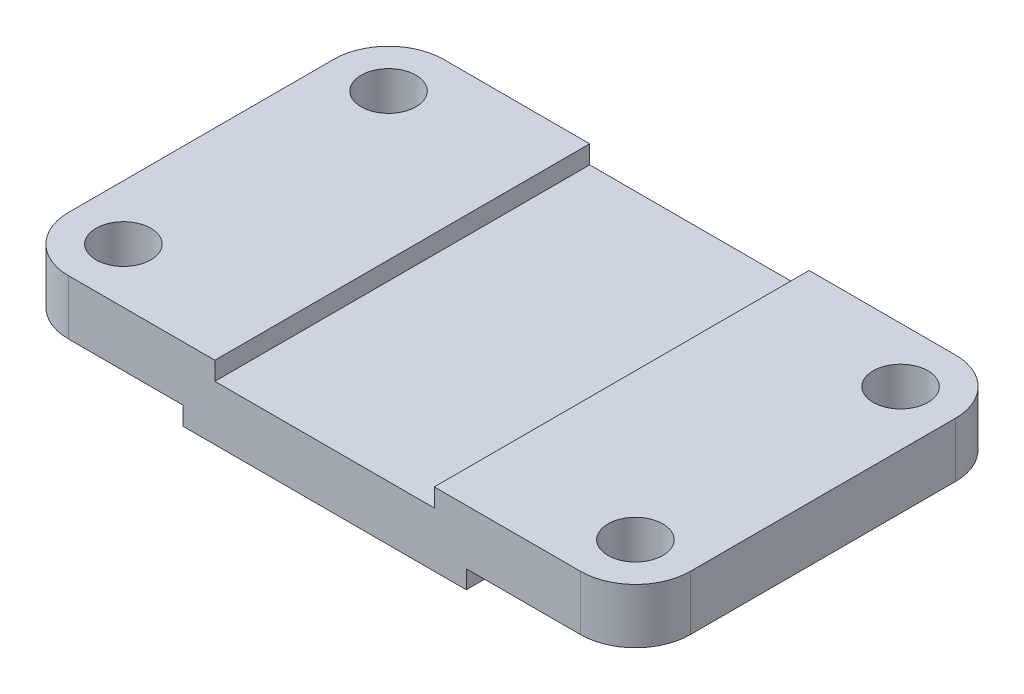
ISO-10303-21;
HEADER;
FILE_DESCRIPTION(('STEP AP214'),'2;1');
FILE_NAME('part.step','',(''),(''),'','','');
FILE_SCHEMA(('AUTOMOTIVE_DESIGN { 1 0 10303 214 1 1 1 1 }'));
ENDSEC;
DATA;
#1=APPLICATION_CONTEXT('core data for automotive mechanical design processes');
#2=APPLICATION_PROTOCOL_DEFINITION('international standard','automotive_design',2000,#1);
#3=PRODUCT_CONTEXT('',#1,'mechanical');
#4=PRODUCT('Part','Part','',(#3));
#5=PRODUCT_RELATED_PRODUCT_CATEGORY('part','',(#4));
#6=PRODUCT_DEFINITION_FORMATION('','',#4);
#7=PRODUCT_DEFINITION_CONTEXT('part definition',#1,'design');
#8=PRODUCT_DEFINITION('design','',#6,#7);
#9=PRODUCT_DEFINITION_SHAPE('','',#8);
#10=(LENGTH_UNIT() NAMED_UNIT(*) SI_UNIT(.MILLI.,.METRE.));
#11=(NAMED_UNIT(*) PLANE_ANGLE_UNIT() SI_UNIT($,.RADIAN.));
#12=(NAMED_UNIT(*) SI_UNIT($,.STERADIAN.) SOLID_ANGLE_UNIT());
#13=UNCERTAINTY_MEASURE_WITH_UNIT(LENGTH_MEASURE(1.E-05),#10,'distance_accuracy_value','');
#14=(GEOMETRIC_REPRESENTATION_CONTEXT(3) GLOBAL_UNCERTAINTY_ASSIGNED_CONTEXT((#13)) GLOBAL_UNIT_ASSIGNED_CONTEXT((#10,
#11,#12)) REPRESENTATION_CONTEXT('',''));
#15=CARTESIAN_POINT('',(0.,0.,0.));
#16=DIRECTION('',(0.,0.,1.));
#17=DIRECTION('',(1.,0.,0.));
#18=AXIS2_PLACEMENT_3D('',#15,#16,#17);
#19=CARTESIAN_POINT('',(-31.,4.00000000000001,41.));
#20=DIRECTION('',(1.,0.,0.));
#21=DIRECTION('',(0.,0.,-1.));
#22=AXIS2_PLACEMENT_3D('',#19,#20,#21);
#23=PLANE('',#22);
#24=DIRECTION('',(0.,-1.,0.));
#25=VECTOR('',#24,1.);
#26=CARTESIAN_POINT('',(-31.,4.00000000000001,-41.));
#27=LINE('',#26,#25);
#28=CARTESIAN_POINT('',(-31.,4.00000000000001,-41.));
#29=VERTEX_POINT('',#28);
#30=CARTESIAN_POINT('',(-31.,0.,-41.));
#31=VERTEX_POINT('',#30);
#32=EDGE_CURVE('E174',#29,#31,#27,.T.);
#33=ORIENTED_EDGE('',*,*,#32,.T.);
#34=DIRECTION('',(0.,0.,-1.));
#35=VECTOR('',#34,1.);
#36=CARTESIAN_POINT('',(-31.,0.,41.));
#37=LINE('',#36,#35);
#38=CARTESIAN_POINT('',(-31.,0.,41.));
#39=VERTEX_POINT('',#38);
#40=EDGE_CURVE('E154',#39,#31,#37,.T.);
#41=ORIENTED_EDGE('',*,*,#40,.F.);
#42=DIRECTION('',(0.,-1.,0.));
#43=VECTOR('',#42,1.);
#44=CARTESIAN_POINT('',(-31.,4.00000000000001,41.));
#45=LINE('',#44,#43);
#46=CARTESIAN_POINT('',(-31.,4.00000000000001,41.));
#47=VERTEX_POINT('',#46);
#48=EDGE_CURVE('E161',#47,#39,#45,.T.);
#49=ORIENTED_EDGE('',*,*,#48,.F.);
#50=DIRECTION('',(0.,0.,-1.));
#51=VECTOR('',#50,1.);
#52=CARTESIAN_POINT('',(-31.,4.00000000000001,41.));
#53=LINE('',#52,#51);
#54=EDGE_CURVE('E247',#47,#29,#53,.T.);
#55=ORIENTED_EDGE('',*,*,#54,.T.);
#56=EDGE_LOOP('',(#33,#41,#49,#55));
#57=FACE_BOUND('',#56,.T.);
#58=ADVANCED_FACE('F33',(#57),#23,.F.);
#59=CARTESIAN_POINT('',(-31.,0.,41.));
#60=DIRECTION('',(0.,1.,0.));
#61=DIRECTION('',(-1.,0.,0.));
#62=AXIS2_PLACEMENT_3D('',#59,#60,#61);
#63=PLANE('',#62);
#64=DIRECTION('',(1.,0.,0.));
#65=VECTOR('',#64,1.);
#66=CARTESIAN_POINT('',(-31.,0.,-41.));
#67=LINE('',#66,#65);
#68=CARTESIAN_POINT('',(31.,0.,-41.));
#69=VERTEX_POINT('',#68);
#70=EDGE_CURVE('E249',#31,#69,#67,.T.);
#71=ORIENTED_EDGE('',*,*,#70,.T.);
#72=DIRECTION('',(0.,0.,-1.));
#73=VECTOR('',#72,1.);
#74=CARTESIAN_POINT('',(31.,0.,41.));
#75=LINE('',#74,#73);
#76=CARTESIAN_POINT('',(31.,0.,41.));
#77=VERTEX_POINT('',#76);
#78=EDGE_CURVE('E157',#77,#69,#75,.T.);
#79=ORIENTED_EDGE('',*,*,#78,.F.);
#80=DIRECTION('',(1.,0.,0.));
#81=VECTOR('',#80,1.);
#82=CARTESIAN_POINT('',(-31.,0.,41.));
#83=LINE('',#82,#81);
#84=EDGE_CURVE('E150',#39,#77,#83,.T.);
#85=ORIENTED_EDGE('',*,*,#84,.F.);
#86=ORIENTED_EDGE('',*,*,#40,.T.);
#87=EDGE_LOOP('',(#71,#79,#85,#86));
#88=FACE_BOUND('',#87,.T.);
#89=ADVANCED_FACE('F152',(#88),#63,.F.);
#90=CARTESIAN_POINT('',(31.,0.,41.));
#91=DIRECTION('',(-1.,0.,0.));
#92=DIRECTION('',(0.,0.,1.));
#93=AXIS2_PLACEMENT_3D('',#90,#91,#92);
#94=PLANE('',#93);
#95=DIRECTION('',(0.,1.,0.));
#96=VECTOR('',#95,1.);
#97=CARTESIAN_POINT('',(31.,0.,-41.));
#98=LINE('',#97,#96);
#99=CARTESIAN_POINT('',(31.,4.00000000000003,-41.));
#100=VERTEX_POINT('',#99);
#101=EDGE_CURVE('E251',#69,#100,#98,.T.);
#102=ORIENTED_EDGE('',*,*,#101,.T.);
#103=DIRECTION('',(0.,0.,-1.));
#104=VECTOR('',#103,1.);
#105=CARTESIAN_POINT('',(31.,4.00000000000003,41.));
#106=LINE('',#105,#104);
#107=CARTESIAN_POINT('',(31.,4.00000000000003,41.));
#108=VERTEX_POINT('',#107);
#109=EDGE_CURVE('E179',#108,#100,#106,.T.);
#110=ORIENTED_EDGE('',*,*,#109,.F.);
#111=DIRECTION('',(0.,1.,0.));
#112=VECTOR('',#111,1.);
#113=CARTESIAN_POINT('',(31.,0.,41.));
#114=LINE('',#113,#112);
#115=EDGE_CURVE('E160',#77,#108,#114,.T.);
#116=ORIENTED_EDGE('',*,*,#115,.F.);
#117=ORIENTED_EDGE('',*,*,#78,.T.);
#118=EDGE_LOOP('',(#102,#110,#116,#117));
#119=FACE_BOUND('',#118,.T.);
#120=ADVANCED_FACE('F349',(#119),#94,.F.);
#121=CARTESIAN_POINT('',(31.,4.00000000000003,41.));
#122=DIRECTION('',(0.,1.,0.));
#123=DIRECTION('',(-1.,0.,0.));
#124=AXIS2_PLACEMENT_3D('',#121,#122,#123);
#125=PLANE('',#124);
#126=CARTESIAN_POINT('',(56.,4.00000000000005,29.));
#127=DIRECTION('',(0.,1.,0.));
#128=DIRECTION('',(-1.,0.,0.));
#129=AXIS2_PLACEMENT_3D('',#126,#127,#128);
#130=CIRCLE('',#129,6.);
#131=CARTESIAN_POINT('',(50.,4.00000000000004,29.));
#132=VERTEX_POINT('',#131);
#133=EDGE_CURVE('E229',#132,#132,#130,.T.);
#134=ORIENTED_EDGE('',*,*,#133,.T.);
#135=EDGE_LOOP('',(#134));
#136=FACE_BOUND('',#135,.T.);
#137=CARTESIAN_POINT('',(56.,4.00000000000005,-29.));
#138=DIRECTION('',(0.,1.,0.));
#139=DIRECTION('',(-1.,0.,0.));
#140=AXIS2_PLACEMENT_3D('',#137,#138,#139);
#141=CIRCLE('',#140,6.);
#142=CARTESIAN_POINT('',(50.,4.00000000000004,-29.));
#143=VERTEX_POINT('',#142);
#144=EDGE_CURVE('E214',#143,#143,#141,.T.);
#145=ORIENTED_EDGE('',*,*,#144,.T.);
#146=EDGE_LOOP('',(#145));
#147=FACE_BOUND('',#146,.T.);
#148=DIRECTION('',(1.,0.,0.));
#149=VECTOR('',#148,1.);
#150=CARTESIAN_POINT('',(31.,4.00000000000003,-41.));
#151=LINE('',#150,#149);
#152=CARTESIAN_POINT('',(56.,4.00000000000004,-41.));
#153=VERTEX_POINT('',#152);
#154=EDGE_CURVE('E253',#100,#153,#151,.T.);
#155=ORIENTED_EDGE('',*,*,#154,.T.);
#156=CARTESIAN_POINT('',(56.,4.00000000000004,-29.));
#157=DIRECTION('',(0.,1.,0.));
#158=DIRECTION('',(-1.,0.,0.));
#159=AXIS2_PLACEMENT_3D('',#156,#157,#158);
#160=CIRCLE('',#159,12.);
#161=CARTESIAN_POINT('',(68.,4.00000000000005,-29.));
#162=VERTEX_POINT('',#161);
#163=EDGE_CURVE('E206',#153,#162,#160,.F.);
#164=ORIENTED_EDGE('',*,*,#163,.T.);
#165=DIRECTION('',(0.,0.,-1.));
#166=VECTOR('',#165,1.);
#167=CARTESIAN_POINT('',(68.,4.00000000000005,41.));
#168=LINE('',#167,#166);
#169=CARTESIAN_POINT('',(68.,4.00000000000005,29.));
#170=VERTEX_POINT('',#169);
#171=EDGE_CURVE('E290',#170,#162,#168,.T.);
#172=ORIENTED_EDGE('',*,*,#171,.F.);
#173=CARTESIAN_POINT('',(56.,4.00000000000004,29.));
#174=DIRECTION('',(0.,1.,0.));
#175=DIRECTION('',(-1.,0.,0.));
#176=AXIS2_PLACEMENT_3D('',#173,#174,#175);
#177=CIRCLE('',#176,12.);
#178=CARTESIAN_POINT('',(56.,4.00000000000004,41.));
#179=VERTEX_POINT('',#178);
#180=EDGE_CURVE('E50',#170,#179,#177,.F.);
#181=ORIENTED_EDGE('',*,*,#180,.T.);
#182=DIRECTION('',(1.,0.,0.));
#183=VECTOR('',#182,1.);
#184=CARTESIAN_POINT('',(31.,4.00000000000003,41.));
#185=LINE('',#184,#183);
#186=EDGE_CURVE('E233',#108,#179,#185,.T.);
#187=ORIENTED_EDGE('',*,*,#186,.F.);
#188=ORIENTED_EDGE('',*,*,#109,.T.);
#189=EDGE_LOOP('',(#155,#164,#172,#181,#187,#188));
#190=FACE_BOUND('',#189,.T.);
#191=ADVANCED_FACE('F295',(#136,#147,#190),#125,.F.);
#192=CARTESIAN_POINT('',(68.,4.00000000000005,41.));
#193=DIRECTION('',(-1.,0.,0.));
#194=DIRECTION('',(0.,0.,1.));
#195=AXIS2_PLACEMENT_3D('',#192,#193,#194);
#196=PLANE('',#195);
#197=ORIENTED_EDGE('',*,*,#171,.T.);
#198=DIRECTION('',(0.,1.,0.));
#199=VECTOR('',#198,1.);
#200=CARTESIAN_POINT('',(68.,4.00000000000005,-29.));
#201=LINE('',#200,#199);
#202=CARTESIAN_POINT('',(68.,16.,-29.));
#203=VERTEX_POINT('',#202);
#204=EDGE_CURVE('E199',#162,#203,#201,.T.);
#205=ORIENTED_EDGE('',*,*,#204,.T.);
#206=DIRECTION('',(0.,0.,-1.));
#207=VECTOR('',#206,1.);
#208=CARTESIAN_POINT('',(68.,16.,41.));
#209=LINE('',#208,#207);
#210=CARTESIAN_POINT('',(68.,16.,29.));
#211=VERTEX_POINT('',#210);
#212=EDGE_CURVE('E287',#211,#203,#209,.T.);
#213=ORIENTED_EDGE('',*,*,#212,.F.);
#214=DIRECTION('',(0.,1.,0.));
#215=VECTOR('',#214,1.);
#216=CARTESIAN_POINT('',(68.,4.00000000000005,29.));
#217=LINE('',#216,#215);
#218=EDGE_CURVE('E197',#211,#170,#217,.F.);
#219=ORIENTED_EDGE('',*,*,#218,.T.);
#220=EDGE_LOOP('',(#197,#205,#213,#219));
#221=FACE_BOUND('',#220,.T.);
#222=ADVANCED_FACE('F309',(#221),#196,.F.);
#223=CARTESIAN_POINT('',(68.,16.,41.));
#224=DIRECTION('',(0.,-1.,0.));
#225=DIRECTION('',(1.,0.,0.));
#226=AXIS2_PLACEMENT_3D('',#223,#224,#225);
#227=PLANE('',#226);
#228=CARTESIAN_POINT('',(56.,16.,29.));
#229=DIRECTION('',(0.,1.,0.));
#230=DIRECTION('',(-1.,0.,0.));
#231=AXIS2_PLACEMENT_3D('',#228,#229,#230);
#232=CIRCLE('',#231,6.);
#233=CARTESIAN_POINT('',(50.,16.,29.));
#234=VERTEX_POINT('',#233);
#235=EDGE_CURVE('E221',#234,#234,#232,.T.);
#236=ORIENTED_EDGE('',*,*,#235,.F.);
#237=EDGE_LOOP('',(#236));
#238=FACE_BOUND('',#237,.T.);
#239=CARTESIAN_POINT('',(56.,16.,-29.));
#240=DIRECTION('',(0.,1.,0.));
#241=DIRECTION('',(-1.,0.,0.));
#242=AXIS2_PLACEMENT_3D('',#239,#240,#241);
#243=CIRCLE('',#242,6.);
#244=CARTESIAN_POINT('',(50.,16.,-29.));
#245=VERTEX_POINT('',#244);
#246=EDGE_CURVE('E216',#245,#245,#243,.T.);
#247=ORIENTED_EDGE('',*,*,#246,.F.);
#248=EDGE_LOOP('',(#247));
#249=FACE_BOUND('',#248,.T.);
#250=ORIENTED_EDGE('',*,*,#212,.T.);
#251=CARTESIAN_POINT('',(56.,16.,-29.));
#252=DIRECTION('',(0.,-1.,0.));
#253=DIRECTION('',(1.,0.,0.));
#254=AXIS2_PLACEMENT_3D('',#251,#252,#253);
#255=CIRCLE('',#254,12.);
#256=CARTESIAN_POINT('',(56.,16.,-41.));
#257=VERTEX_POINT('',#256);
#258=EDGE_CURVE('E203',#203,#257,#255,.F.);
#259=ORIENTED_EDGE('',*,*,#258,.T.);
#260=DIRECTION('',(-1.,0.,0.));
#261=VECTOR('',#260,1.);
#262=CARTESIAN_POINT('',(68.,16.,-41.));
#263=LINE('',#262,#261);
#264=CARTESIAN_POINT('',(24.,16.,-41.));
#265=VERTEX_POINT('',#264);
#266=EDGE_CURVE('E256',#257,#265,#263,.T.);
#267=ORIENTED_EDGE('',*,*,#266,.T.);
#268=DIRECTION('',(0.,0.,-1.));
#269=VECTOR('',#268,1.);
#270=CARTESIAN_POINT('',(24.,16.,41.));
#271=LINE('',#270,#269);
#272=CARTESIAN_POINT('',(24.,16.,41.));
#273=VERTEX_POINT('',#272);
#274=EDGE_CURVE('E284',#273,#265,#271,.T.);
#275=ORIENTED_EDGE('',*,*,#274,.F.);
#276=DIRECTION('',(-1.,0.,0.));
#277=VECTOR('',#276,1.);
#278=CARTESIAN_POINT('',(68.,16.,41.));
#279=LINE('',#278,#277);
#280=CARTESIAN_POINT('',(56.,16.,41.));
#281=VERTEX_POINT('',#280);
#282=EDGE_CURVE('E235',#281,#273,#279,.T.);
#283=ORIENTED_EDGE('',*,*,#282,.F.);
#284=CARTESIAN_POINT('',(56.,16.,29.));
#285=DIRECTION('',(0.,-1.,0.));
#286=DIRECTION('',(1.,0.,0.));
#287=AXIS2_PLACEMENT_3D('',#284,#285,#286);
#288=CIRCLE('',#287,12.);
#289=EDGE_CURVE('E58',#281,#211,#288,.F.);
#290=ORIENTED_EDGE('',*,*,#289,.T.);
#291=EDGE_LOOP('',(#250,#259,#267,#275,#283,#290));
#292=FACE_BOUND('',#291,.T.);
#293=ADVANCED_FACE('F315',(#238,#249,#292),#227,.F.);
#294=CARTESIAN_POINT('',(24.,12.,41.));
#295=DIRECTION('',(1.,0.,0.));
#296=DIRECTION('',(0.,0.,-1.));
#297=AXIS2_PLACEMENT_3D('',#294,#295,#296);
#298=PLANE('',#297);
#299=DIRECTION('',(0.,-1.,0.));
#300=VECTOR('',#299,1.);
#301=CARTESIAN_POINT('',(24.,12.,-41.));
#302=LINE('',#301,#300);
#303=CARTESIAN_POINT('',(24.,12.,-41.));
#304=VERTEX_POINT('',#303);
#305=EDGE_CURVE('E258',#265,#304,#302,.T.);
#306=ORIENTED_EDGE('',*,*,#305,.T.);
#307=DIRECTION('',(0.,0.,-1.));
#308=VECTOR('',#307,1.);
#309=CARTESIAN_POINT('',(24.,12.,41.));
#310=LINE('',#309,#308);
#311=CARTESIAN_POINT('',(24.,12.,41.));
#312=VERTEX_POINT('',#311);
#313=EDGE_CURVE('E281',#312,#304,#310,.T.);
#314=ORIENTED_EDGE('',*,*,#313,.F.);
#315=DIRECTION('',(0.,-1.,0.));
#316=VECTOR('',#315,1.);
#317=CARTESIAN_POINT('',(24.,12.,41.));
#318=LINE('',#317,#316);
#319=EDGE_CURVE('E237',#273,#312,#318,.T.);
#320=ORIENTED_EDGE('',*,*,#319,.F.);
#321=ORIENTED_EDGE('',*,*,#274,.T.);
#322=EDGE_LOOP('',(#306,#314,#320,#321));
#323=FACE_BOUND('',#322,.T.);
#324=ADVANCED_FACE('F319',(#323),#298,.F.);
#325=CARTESIAN_POINT('',(-24.,12.,41.));
#326=DIRECTION('',(0.,-1.,0.));
#327=DIRECTION('',(0.,0.,-1.));
#328=AXIS2_PLACEMENT_3D('',#325,#326,#327);
#329=PLANE('',#328);
#330=DIRECTION('',(-1.,0.,0.));
#331=VECTOR('',#330,1.);
#332=CARTESIAN_POINT('',(-24.,12.,-41.));
#333=LINE('',#332,#331);
#334=CARTESIAN_POINT('',(-24.,12.,-41.));
#335=VERTEX_POINT('',#334);
#336=EDGE_CURVE('E260',#304,#335,#333,.T.);
#337=ORIENTED_EDGE('',*,*,#336,.T.);
#338=DIRECTION('',(0.,0.,-1.));
#339=VECTOR('',#338,1.);
#340=CARTESIAN_POINT('',(-24.,12.,41.));
#341=LINE('',#340,#339);
#342=CARTESIAN_POINT('',(-24.,12.,41.));
#343=VERTEX_POINT('',#342);
#344=EDGE_CURVE('E278',#343,#335,#341,.T.);
#345=ORIENTED_EDGE('',*,*,#344,.F.);
#346=DIRECTION('',(-1.,0.,0.));
#347=VECTOR('',#346,1.);
#348=CARTESIAN_POINT('',(-24.,12.,41.));
#349=LINE('',#348,#347);
#350=EDGE_CURVE('E239',#312,#343,#349,.T.);
#351=ORIENTED_EDGE('',*,*,#350,.F.);
#352=ORIENTED_EDGE('',*,*,#313,.T.);
#353=EDGE_LOOP('',(#337,#345,#351,#352));
#354=FACE_BOUND('',#353,.T.);
#355=ADVANCED_FACE('F325',(#354),#329,.F.);
#356=CARTESIAN_POINT('',(-24.,16.,41.));
#357=DIRECTION('',(-1.,0.,0.));
#358=DIRECTION('',(0.,0.,1.));
#359=AXIS2_PLACEMENT_3D('',#356,#357,#358);
#360=PLANE('',#359);
#361=DIRECTION('',(0.,1.,0.));
#362=VECTOR('',#361,1.);
#363=CARTESIAN_POINT('',(-24.,16.,-41.));
#364=LINE('',#363,#362);
#365=CARTESIAN_POINT('',(-24.,16.,-41.));
#366=VERTEX_POINT('',#365);
#367=EDGE_CURVE('E262',#335,#366,#364,.T.);
#368=ORIENTED_EDGE('',*,*,#367,.T.);
#369=DIRECTION('',(0.,0.,-1.));
#370=VECTOR('',#369,1.);
#371=CARTESIAN_POINT('',(-24.,16.,41.));
#372=LINE('',#371,#370);
#373=CARTESIAN_POINT('',(-24.,16.,41.));
#374=VERTEX_POINT('',#373);
#375=EDGE_CURVE('E275',#374,#366,#372,.T.);
#376=ORIENTED_EDGE('',*,*,#375,.F.);
#377=DIRECTION('',(0.,1.,0.));
#378=VECTOR('',#377,1.);
#379=CARTESIAN_POINT('',(-24.,16.,41.));
#380=LINE('',#379,#378);
#381=EDGE_CURVE('E241',#343,#374,#380,.T.);
#382=ORIENTED_EDGE('',*,*,#381,.F.);
#383=ORIENTED_EDGE('',*,*,#344,.T.);
#384=EDGE_LOOP('',(#368,#376,#382,#383));
#385=FACE_BOUND('',#384,.T.);
#386=ADVANCED_FACE('F329',(#385),#360,.F.);
#387=CARTESIAN_POINT('',(-24.,16.,41.));
#388=DIRECTION('',(0.,-1.,0.));
#389=DIRECTION('',(1.,0.,0.));
#390=AXIS2_PLACEMENT_3D('',#387,#388,#389);
#391=PLANE('',#390);
#392=CARTESIAN_POINT('',(-56.,16.,29.));
#393=DIRECTION('',(0.,1.,0.));
#394=DIRECTION('',(-1.,0.,0.));
#395=AXIS2_PLACEMENT_3D('',#392,#393,#394);
#396=CIRCLE('',#395,6.);
#397=CARTESIAN_POINT('',(-62.,16.,29.));
#398=VERTEX_POINT('',#397);
#399=EDGE_CURVE('E225',#398,#398,#396,.T.);
#400=ORIENTED_EDGE('',*,*,#399,.F.);
#401=EDGE_LOOP('',(#400));
#402=FACE_BOUND('',#401,.T.);
#403=CARTESIAN_POINT('',(-56.,16.,-29.));
#404=DIRECTION('',(0.,1.,0.));
#405=DIRECTION('',(-1.,0.,0.));
#406=AXIS2_PLACEMENT_3D('',#403,#404,#405);
#407=CIRCLE('',#406,6.);
#408=CARTESIAN_POINT('',(-62.,16.,-29.));
#409=VERTEX_POINT('',#408);
#410=EDGE_CURVE('E210',#409,#409,#407,.T.);
#411=ORIENTED_EDGE('',*,*,#410,.F.);
#412=EDGE_LOOP('',(#411));
#413=FACE_BOUND('',#412,.T.);
#414=DIRECTION('',(-1.,0.,0.));
#415=VECTOR('',#414,1.);
#416=CARTESIAN_POINT('',(-24.,16.,-41.));
#417=LINE('',#416,#415);
#418=CARTESIAN_POINT('',(-56.,16.,-41.));
#419=VERTEX_POINT('',#418);
#420=EDGE_CURVE('E264',#366,#419,#417,.T.);
#421=ORIENTED_EDGE('',*,*,#420,.T.);
#422=CARTESIAN_POINT('',(-56.,16.,-29.));
#423=DIRECTION('',(0.,-1.,0.));
#424=DIRECTION('',(1.,0.,0.));
#425=AXIS2_PLACEMENT_3D('',#422,#423,#424);
#426=CIRCLE('',#425,12.);
#427=CARTESIAN_POINT('',(-68.,16.,-29.));
#428=VERTEX_POINT('',#427);
#429=EDGE_CURVE('E195',#419,#428,#426,.F.);
#430=ORIENTED_EDGE('',*,*,#429,.T.);
#431=DIRECTION('',(0.,0.,-1.));
#432=VECTOR('',#431,1.);
#433=CARTESIAN_POINT('',(-68.,16.,41.));
#434=LINE('',#433,#432);
#435=CARTESIAN_POINT('',(-68.,16.,29.));
#436=VERTEX_POINT('',#435);
#437=EDGE_CURVE('E272',#436,#428,#434,.T.);
#438=ORIENTED_EDGE('',*,*,#437,.F.);
#439=CARTESIAN_POINT('',(-56.,16.,29.));
#440=DIRECTION('',(0.,-1.,0.));
#441=DIRECTION('',(1.,0.,0.));
#442=AXIS2_PLACEMENT_3D('',#439,#440,#441);
#443=CIRCLE('',#442,12.);
#444=CARTESIAN_POINT('',(-56.,16.,41.));
#445=VERTEX_POINT('',#444);
#446=EDGE_CURVE('E193',#436,#445,#443,.F.);
#447=ORIENTED_EDGE('',*,*,#446,.T.);
#448=DIRECTION('',(-1.,0.,0.));
#449=VECTOR('',#448,1.);
#450=CARTESIAN_POINT('',(-24.,16.,41.));
#451=LINE('',#450,#449);
#452=EDGE_CURVE('E243',#374,#445,#451,.T.);
#453=ORIENTED_EDGE('',*,*,#452,.F.);
#454=ORIENTED_EDGE('',*,*,#375,.T.);
#455=EDGE_LOOP('',(#421,#430,#438,#447,#453,#454));
#456=FACE_BOUND('',#455,.T.);
#457=ADVANCED_FACE('F333',(#402,#413,#456),#391,.F.);
#458=CARTESIAN_POINT('',(-68.,16.,41.));
#459=DIRECTION('',(1.,0.,0.));
#460=DIRECTION('',(0.,0.,-1.));
#461=AXIS2_PLACEMENT_3D('',#458,#459,#460);
#462=PLANE('',#461);
#463=ORIENTED_EDGE('',*,*,#437,.T.);
#464=DIRECTION('',(0.,-1.,0.));
#465=VECTOR('',#464,1.);
#466=CARTESIAN_POINT('',(-68.,16.,-29.));
#467=LINE('',#466,#465);
#468=CARTESIAN_POINT('',(-68.,4.00000000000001,-29.));
#469=VERTEX_POINT('',#468);
#470=EDGE_CURVE('E177',#428,#469,#467,.T.);
#471=ORIENTED_EDGE('',*,*,#470,.T.);
#472=DIRECTION('',(0.,0.,-1.));
#473=VECTOR('',#472,1.);
#474=CARTESIAN_POINT('',(-68.,4.00000000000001,41.));
#475=LINE('',#474,#473);
#476=CARTESIAN_POINT('',(-68.,4.00000000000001,29.));
#477=VERTEX_POINT('',#476);
#478=EDGE_CURVE('E269',#477,#469,#475,.T.);
#479=ORIENTED_EDGE('',*,*,#478,.F.);
#480=DIRECTION('',(0.,-1.,0.));
#481=VECTOR('',#480,1.);
#482=CARTESIAN_POINT('',(-68.,16.,29.));
#483=LINE('',#482,#481);
#484=EDGE_CURVE('E175',#477,#436,#483,.F.);
#485=ORIENTED_EDGE('',*,*,#484,.T.);
#486=EDGE_LOOP('',(#463,#471,#479,#485));
#487=FACE_BOUND('',#486,.T.);
#488=ADVANCED_FACE('F343',(#487),#462,.F.);
#489=CARTESIAN_POINT('',(-68.,4.00000000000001,41.));
#490=DIRECTION('',(0.,1.,0.));
#491=DIRECTION('',(0.,0.,1.));
#492=AXIS2_PLACEMENT_3D('',#489,#490,#491);
#493=PLANE('',#492);
#494=CARTESIAN_POINT('',(-56.,4.,29.));
#495=DIRECTION('',(0.,1.,0.));
#496=DIRECTION('',(0.,0.,1.));
#497=AXIS2_PLACEMENT_3D('',#494,#495,#496);
#498=CIRCLE('',#497,6.);
#499=CARTESIAN_POINT('',(-56.,4.,35.));
#500=VERTEX_POINT('',#499);
#501=EDGE_CURVE('E37',#500,#500,#498,.T.);
#502=ORIENTED_EDGE('',*,*,#501,.T.);
#503=EDGE_LOOP('',(#502));
#504=FACE_BOUND('',#503,.T.);
#505=CARTESIAN_POINT('',(-56.,4.,-29.));
#506=DIRECTION('',(0.,1.,0.));
#507=DIRECTION('',(0.,0.,1.));
#508=AXIS2_PLACEMENT_3D('',#505,#506,#507);
#509=CIRCLE('',#508,6.);
#510=CARTESIAN_POINT('',(-56.,4.,-23.));
#511=VERTEX_POINT('',#510);
#512=EDGE_CURVE('E208',#511,#511,#509,.T.);
#513=ORIENTED_EDGE('',*,*,#512,.T.);
#514=EDGE_LOOP('',(#513));
#515=FACE_BOUND('',#514,.T.);
#516=ORIENTED_EDGE('',*,*,#478,.T.);
#517=CARTESIAN_POINT('',(-56.,4.00000000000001,-29.));
#518=DIRECTION('',(0.,1.,0.));
#519=DIRECTION('',(0.,0.,1.));
#520=AXIS2_PLACEMENT_3D('',#517,#518,#519);
#521=CIRCLE('',#520,12.);
#522=CARTESIAN_POINT('',(-56.,4.00000000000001,-41.));
#523=VERTEX_POINT('',#522);
#524=EDGE_CURVE('E187',#469,#523,#521,.F.);
#525=ORIENTED_EDGE('',*,*,#524,.T.);
#526=DIRECTION('',(1.,0.,0.));
#527=VECTOR('',#526,1.);
#528=CARTESIAN_POINT('',(-68.,4.00000000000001,-41.));
#529=LINE('',#528,#527);
#530=EDGE_CURVE('E171',#523,#29,#529,.T.);
#531=ORIENTED_EDGE('',*,*,#530,.T.);
#532=ORIENTED_EDGE('',*,*,#54,.F.);
#533=DIRECTION('',(1.,0.,0.));
#534=VECTOR('',#533,1.);
#535=CARTESIAN_POINT('',(-68.,4.00000000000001,41.));
#536=LINE('',#535,#534);
#537=CARTESIAN_POINT('',(-56.,4.00000000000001,41.));
#538=VERTEX_POINT('',#537);
#539=EDGE_CURVE('E167',#538,#47,#536,.T.);
#540=ORIENTED_EDGE('',*,*,#539,.F.);
#541=CARTESIAN_POINT('',(-56.,4.00000000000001,29.));
#542=DIRECTION('',(0.,1.,0.));
#543=DIRECTION('',(0.,0.,1.));
#544=AXIS2_PLACEMENT_3D('',#541,#542,#543);
#545=CIRCLE('',#544,12.);
#546=EDGE_CURVE('E185',#538,#477,#545,.F.);
#547=ORIENTED_EDGE('',*,*,#546,.T.);
#548=EDGE_LOOP('',(#516,#525,#531,#532,#540,#547));
#549=FACE_BOUND('',#548,.T.);
#550=ADVANCED_FACE('F341',(#504,#515,#549),#493,.F.);
#551=CARTESIAN_POINT('',(0.,0.,41.));
#552=DIRECTION('',(0.,0.,1.));
#553=DIRECTION('',(1.,0.,0.));
#554=AXIS2_PLACEMENT_3D('',#551,#552,#553);
#555=PLANE('',#554);
#556=ORIENTED_EDGE('',*,*,#186,.T.);
#557=DIRECTION('',(0.,1.,0.));
#558=VECTOR('',#557,1.);
#559=CARTESIAN_POINT('',(56.,16.,41.));
#560=LINE('',#559,#558);
#561=EDGE_CURVE('E11',#179,#281,#560,.T.);
#562=ORIENTED_EDGE('',*,*,#561,.T.);
#563=ORIENTED_EDGE('',*,*,#282,.T.);
#564=ORIENTED_EDGE('',*,*,#319,.T.);
#565=ORIENTED_EDGE('',*,*,#350,.T.);
#566=ORIENTED_EDGE('',*,*,#381,.T.);
#567=ORIENTED_EDGE('',*,*,#452,.T.);
#568=DIRECTION('',(0.,-1.,0.));
#569=VECTOR('',#568,1.);
#570=CARTESIAN_POINT('',(-56.,4.00000000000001,41.));
#571=LINE('',#570,#569);
#572=EDGE_CURVE('E42',#445,#538,#571,.T.);
#573=ORIENTED_EDGE('',*,*,#572,.T.);
#574=ORIENTED_EDGE('',*,*,#539,.T.);
#575=ORIENTED_EDGE('',*,*,#48,.T.);
#576=ORIENTED_EDGE('',*,*,#84,.T.);
#577=ORIENTED_EDGE('',*,*,#115,.T.);
#578=EDGE_LOOP('',(#556,#562,#563,#564,#565,#566,#567,#573,#574,#575,#576,#577));
#579=FACE_BOUND('',#578,.T.);
#580=ADVANCED_FACE('F164',(#579),#555,.T.);
#581=CARTESIAN_POINT('',(0.,0.,-41.));
#582=DIRECTION('',(0.,0.,1.));
#583=DIRECTION('',(1.,0.,0.));
#584=AXIS2_PLACEMENT_3D('',#581,#582,#583);
#585=PLANE('',#584);
#586=ORIENTED_EDGE('',*,*,#530,.F.);
#587=DIRECTION('',(0.,-1.,0.));
#588=VECTOR('',#587,1.);
#589=CARTESIAN_POINT('',(-56.,0.,-41.));
#590=LINE('',#589,#588);
#591=EDGE_CURVE('E191',#523,#419,#590,.F.);
#592=ORIENTED_EDGE('',*,*,#591,.T.);
#593=ORIENTED_EDGE('',*,*,#420,.F.);
#594=ORIENTED_EDGE('',*,*,#367,.F.);
#595=ORIENTED_EDGE('',*,*,#336,.F.);
#596=ORIENTED_EDGE('',*,*,#305,.F.);
#597=ORIENTED_EDGE('',*,*,#266,.F.);
#598=DIRECTION('',(0.,1.,0.));
#599=VECTOR('',#598,1.);
#600=CARTESIAN_POINT('',(56.,0.,-41.));
#601=LINE('',#600,#599);
#602=EDGE_CURVE('E189',#257,#153,#601,.F.);
#603=ORIENTED_EDGE('',*,*,#602,.T.);
#604=ORIENTED_EDGE('',*,*,#154,.F.);
#605=ORIENTED_EDGE('',*,*,#101,.F.);
#606=ORIENTED_EDGE('',*,*,#70,.F.);
#607=ORIENTED_EDGE('',*,*,#32,.F.);
#608=EDGE_LOOP('',(#586,#592,#593,#594,#595,#596,#597,#603,#604,#605,#606,#607));
#609=FACE_BOUND('',#608,.T.);
#610=ADVANCED_FACE('F301',(#609),#585,.F.);
#611=CARTESIAN_POINT('',(-56.,16.,-29.));
#612=DIRECTION('',(0.,-1.,0.));
#613=DIRECTION('',(0.,0.,-1.));
#614=AXIS2_PLACEMENT_3D('',#611,#612,#613);
#615=CYLINDRICAL_SURFACE('',#614,12.);
#616=ORIENTED_EDGE('',*,*,#429,.F.);
#617=ORIENTED_EDGE('',*,*,#591,.F.);
#618=ORIENTED_EDGE('',*,*,#524,.F.);
#619=ORIENTED_EDGE('',*,*,#470,.F.);
#620=EDGE_LOOP('',(#616,#617,#618,#619));
#621=FACE_BOUND('',#620,.T.);
#622=ADVANCED_FACE('F347',(#621),#615,.T.);
#623=CARTESIAN_POINT('',(56.,4.00000000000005,-29.));
#624=DIRECTION('',(0.,1.,0.));
#625=DIRECTION('',(0.,0.,1.));
#626=AXIS2_PLACEMENT_3D('',#623,#624,#625);
#627=CYLINDRICAL_SURFACE('',#626,12.);
#628=ORIENTED_EDGE('',*,*,#163,.F.);
#629=ORIENTED_EDGE('',*,*,#602,.F.);
#630=ORIENTED_EDGE('',*,*,#258,.F.);
#631=ORIENTED_EDGE('',*,*,#204,.F.);
#632=EDGE_LOOP('',(#628,#629,#630,#631));
#633=FACE_BOUND('',#632,.T.);
#634=ADVANCED_FACE('F306',(#633),#627,.T.);
#635=CARTESIAN_POINT('',(56.,0.,29.));
#636=DIRECTION('',(0.,-1.,0.));
#637=DIRECTION('',(0.,0.,-1.));
#638=AXIS2_PLACEMENT_3D('',#635,#636,#637);
#639=CYLINDRICAL_SURFACE('',#638,12.);
#640=ORIENTED_EDGE('',*,*,#180,.F.);
#641=ORIENTED_EDGE('',*,*,#218,.F.);
#642=ORIENTED_EDGE('',*,*,#289,.F.);
#643=ORIENTED_EDGE('',*,*,#561,.F.);
#644=EDGE_LOOP('',(#640,#641,#642,#643));
#645=FACE_BOUND('',#644,.T.);
#646=ADVANCED_FACE('F311',(#645),#639,.T.);
#647=CARTESIAN_POINT('',(-56.,0.,29.));
#648=DIRECTION('',(0.,1.,0.));
#649=DIRECTION('',(0.,0.,1.));
#650=AXIS2_PLACEMENT_3D('',#647,#648,#649);
#651=CYLINDRICAL_SURFACE('',#650,12.);
#652=ORIENTED_EDGE('',*,*,#446,.F.);
#653=ORIENTED_EDGE('',*,*,#484,.F.);
#654=ORIENTED_EDGE('',*,*,#546,.F.);
#655=ORIENTED_EDGE('',*,*,#572,.F.);
#656=EDGE_LOOP('',(#652,#653,#654,#655));
#657=FACE_BOUND('',#656,.T.);
#658=ADVANCED_FACE('F35',(#657),#651,.T.);
#659=CARTESIAN_POINT('',(-56.,-66.,-29.));
#660=DIRECTION('',(0.,1.,0.));
#661=DIRECTION('',(-1.,0.,0.));
#662=AXIS2_PLACEMENT_3D('',#659,#660,#661);
#663=CYLINDRICAL_SURFACE('',#662,6.);
#664=ORIENTED_EDGE('',*,*,#410,.T.);
#665=EDGE_LOOP('',(#664));
#666=FACE_BOUND('',#665,.T.);
#667=ORIENTED_EDGE('',*,*,#512,.F.);
#668=EDGE_LOOP('',(#667));
#669=FACE_BOUND('',#668,.T.);
#670=ADVANCED_FACE('F371',(#666,#669),#663,.F.);
#671=CARTESIAN_POINT('',(-56.,-66.,29.));
#672=DIRECTION('',(0.,1.,0.));
#673=DIRECTION('',(-1.,0.,0.));
#674=AXIS2_PLACEMENT_3D('',#671,#672,#673);
#675=CYLINDRICAL_SURFACE('',#674,6.);
#676=ORIENTED_EDGE('',*,*,#399,.T.);
#677=EDGE_LOOP('',(#676));
#678=FACE_BOUND('',#677,.T.);
#679=ORIENTED_EDGE('',*,*,#501,.F.);
#680=EDGE_LOOP('',(#679));
#681=FACE_BOUND('',#680,.T.);
#682=ADVANCED_FACE('F375',(#678,#681),#675,.F.);
#683=CARTESIAN_POINT('',(56.,-66.,-29.));
#684=DIRECTION('',(0.,1.,0.));
#685=DIRECTION('',(-1.,0.,0.));
#686=AXIS2_PLACEMENT_3D('',#683,#684,#685);
#687=CYLINDRICAL_SURFACE('',#686,6.);
#688=ORIENTED_EDGE('',*,*,#246,.T.);
#689=EDGE_LOOP('',(#688));
#690=FACE_BOUND('',#689,.T.);
#691=ORIENTED_EDGE('',*,*,#144,.F.);
#692=EDGE_LOOP('',(#691));
#693=FACE_BOUND('',#692,.T.);
#694=ADVANCED_FACE('F380',(#690,#693),#687,.F.);
#695=CARTESIAN_POINT('',(56.,-66.,29.));
#696=DIRECTION('',(0.,1.,0.));
#697=DIRECTION('',(-1.,0.,0.));
#698=AXIS2_PLACEMENT_3D('',#695,#696,#697);
#699=CYLINDRICAL_SURFACE('',#698,6.);
#700=ORIENTED_EDGE('',*,*,#235,.T.);
#701=EDGE_LOOP('',(#700));
#702=FACE_BOUND('',#701,.T.);
#703=ORIENTED_EDGE('',*,*,#133,.F.);
#704=EDGE_LOOP('',(#703));
#705=FACE_BOUND('',#704,.T.);
#706=ADVANCED_FACE('F523',(#702,#705),#699,.F.);
#707=CLOSED_SHELL('',(#58,#89,#120,#191,#222,#293,#324,#355,#386,#457,#488,#550,#580,#610,#622,
#634,#646,#658,#670,#682,#694,#706));
#708=MANIFOLD_SOLID_BREP('B2',#707);
#709=ADVANCED_BREP_SHAPE_REPRESENTATION('',(#18,#708),#14);
#710=SHAPE_DEFINITION_REPRESENTATION(#9,#709);
ENDSEC;
END-ISO-10303-21;
